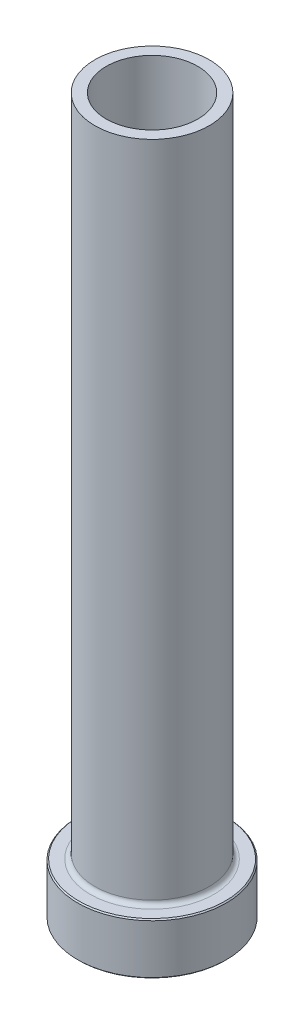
from build123d import *

# Parameters (mm, degrees)
FILLET1_R     = 0.8
CHAMFER1_SIZE = 0.2
CHAMFER3_SIZE = 0.5


with BuildPart() as part:
    # Sketch1 → Revolve1 (revolve)
    with BuildSketch(Plane.XY, mode=Mode.PRIVATE) as revolve1_sk:
        Polygon((-8, 125), (-10, 125), (-10, 9), (-13, 9), (-13, 0), (-8.25, 0), (-8.25, 58), (-8, 70), align=None)
    revolve(revolve1_sk.sketch.rotate(Axis((0, 92.187680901, 0), (0, -1, 0)), 270), axis=Axis((0, 92.187680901, 0), (0, -1, 0)))

    # Fillet1
    fillet1_edges = [part.edges().sort_by_distance(p)[0] for p in [
        (0, 9, -10),
    ]]
    fillet(fillet1_edges, radius=FILLET1_R)

    # Chamfer1
    chamfer1_edges = [part.edges().sort_by_distance(p)[0] for p in [
        (0, 0, -13),
        (0, 9, -13),
    ]]
    chamfer(chamfer1_edges, length=CHAMFER1_SIZE)

    # Chamfer3
    chamfer3_edges = [part.edges().sort_by_distance(p)[0] for p in [
        (0, 0, -8.25),
    ]]
    chamfer(chamfer3_edges, length=CHAMFER3_SIZE)


solid = part.part
